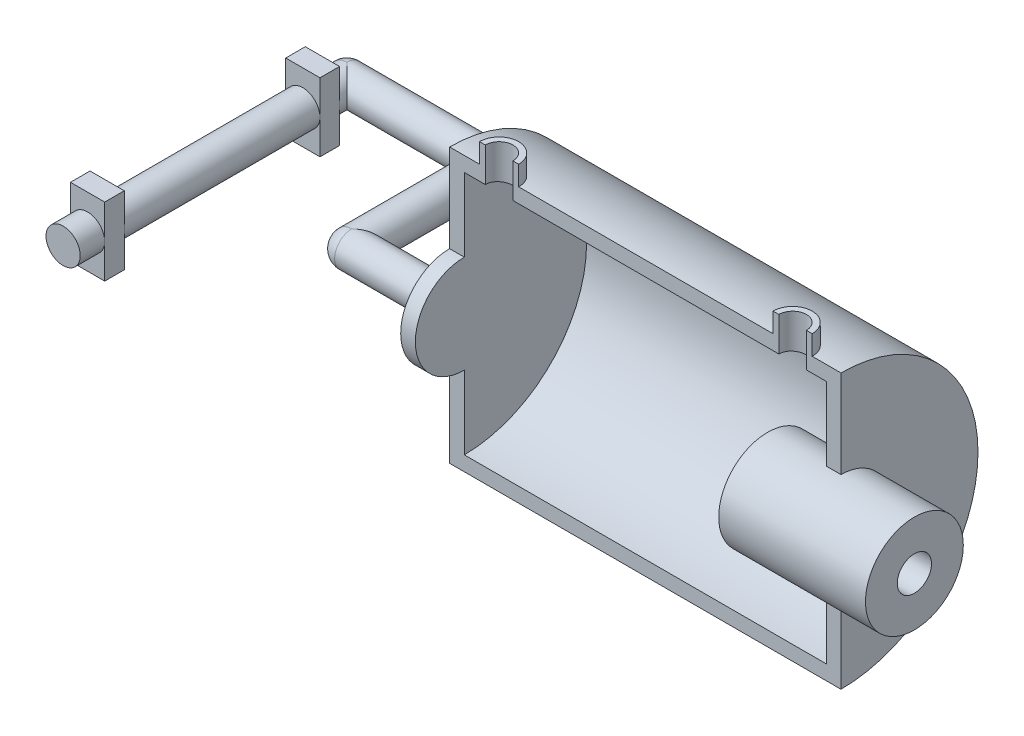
from build123d import *
from build123d.topology import SkipClean

# Parameters (mm, degrees)
ESQUISSE1_R                = 3.5
EXTRUSION1_DEPTH           = 20
ESQUISSE2_W                = 7
ESQUISSE2_H                = 14
EXTRUSION2_DEPTH           = 4
EXTRUSION3_DEPTH           = 5
ESQUISSE4_R                = 3.5
EXTRUSION4_DEPTH           = 30
ESQUISSE5_W                = 3.5
ESQUISSE5_H                = 29
ESQUISSE6_W                = 20
ESQUISSE6_H                = 3.5
EXTRUSION5_DEPTH           = 15
EXTRUSION5_DEPTH_BACK      = 15
ESQUISSE8_R                = 10
ENL_V_MAT_EXTRU_1_DEPTH    = 91
ENL_V_START                = -65
ESQUISSE10_R               = 3.5
ENL_V_MAT_EXTRU_2_DEPTH    = 65
ESQUISSE14_W               = 4
ESQUISSE14_H               = 7
ENL_V_MAT_EXTRU_3_DEPTH    = 15
R_P_TITION_LIN_AIRE1_COUNT = 16
R_P_TITION_LIN_AIRE1_PITCH = 60


with BuildPart() as part:
    # Esquisse1 → Extrusion1 (new body)
    with BuildSketch(Plane.XY):
        Circle(ESQUISSE1_R)
    extrusion1 = extrude(amount=-EXTRUSION1_DEPTH)

    # Esquisse2 → Extrusion2 (add)
    with BuildSketch(Plane(origin=(0, 0, -20), x_dir=(-1, 0, 0), z_dir=(0, 0, -1))):
        Rectangle(ESQUISSE2_W, ESQUISSE2_H)
    extrusion2 = extrude(amount=EXTRUSION2_DEPTH)

    # Esquisse3 → Extrusion3 (add)
    with BuildSketch(Plane(origin=(0, 0, -24), x_dir=(-1, 0, 0), z_dir=(0, 0, -1))):
        with BuildLine():
            ThreePointArc((3.5, 0), (0, 3.5), (-3.5, 0))
            ThreePointArc((-3.5, 0), (0, -3.5), (3.5, 0))
        make_face()
    extrusion3 = extrude(amount=EXTRUSION3_DEPTH)

    # Sym_trie1: Extrusion1, Extrusion2, Extrusion3 across plane
    add(extrusion1.mirror(Plane.XY))
    add(extrusion2.mirror(Plane.XY))
    add(extrusion3.mirror(Plane.XY))

    # Esquisse4 → Extrusion4 (add)
    with BuildSketch(Plane(origin=(0, 0, 0), x_dir=(0, 0, -1), z_dir=(1, 0, 0))):
        with Locations(Location((29, 0, 0), (0, 0, 180))):
            Circle(ESQUISSE4_R)
    extrude(amount=EXTRUSION4_DEPTH)

    # Esquisse5 → R_volution1 (revolve)
    with BuildSketch(Plane(origin=(0, 0, 0), x_dir=(1, 0, 0), z_dir=(0, 1, 0)), mode=Mode.PRIVATE) as r_volution1_sk:
        with Locations((31.75, 14.5)):
            Rectangle(ESQUISSE5_W, ESQUISSE5_H)
    revolve(r_volution1_sk.sketch.rotate(Axis((30, 0, -29), (0, 0, 1)), 180), axis=Axis((30, 0, -29), (0, 0, 1)))

    # Esquisse6 → R_volution2 (revolve)
    with BuildSketch(Plane(origin=(0, 0, 0), x_dir=(1, 0, 0), z_dir=(0, 1, 0)), mode=Mode.PRIVATE) as r_volution2_sk:
        with Locations((40, 1.75)):
            Rectangle(ESQUISSE6_W, ESQUISSE6_H)
    revolve(r_volution2_sk.sketch.rotate(Axis((26.5, 0, 0), (1, 0, 0)), 180), axis=Axis((26.5, 0, 0), (1, 0, 0)))

    # Esquisse7 → R_volution3 (revolve)
    with BuildSketch(Plane.XY, mode=Mode.PRIVATE) as r_volution3_sk:
        Polygon((50, 0), (50, 28), (130, 28), (130, 0), (127, 0), (127, 25), (53, 25), (53, 0), align=None)
    revolve(r_volution3_sk.sketch.rotate(Axis((0, 0, 0), (1, 0, 0)), 90), axis=Axis((0, 0, 0), (1, 0, 0)))

    # Esquisse8 → Extrusion5 (add, two sides: drawn at the far end of the back side and taken through both)
    with BuildSketch(Plane(origin=(130, 0, 0), x_dir=(0, 0, -1), z_dir=(1, 0, 0)).offset(-EXTRUSION5_DEPTH_BACK)):
        with Locations(Location((0, 0, 0), (0, 0, 180))):
            Circle(ESQUISSE8_R)
    extrude(amount=EXTRUSION5_DEPTH + EXTRUSION5_DEPTH_BACK)

    # Esquisse9 → Enl_v. mat.-Extru.1 (cut)
    with SkipClean():  # the faces are left unmerged after this step: merging them gives an invalid solid
        with BuildSketch(Plane(origin=(130, 0, 0), x_dir=(0, 0, -1), z_dir=(1, 0, 0))):
            with BuildLine():
                Line((0, 28), (0, 10))
                ThreePointArc((0, 10), (-10, 0), (0, -10))
                Line((0, -10), (0, -28))
                ThreePointArc((0, -28), (-28, 0), (0, 28))
            make_face()
        extrude(amount=-ENL_V_MAT_EXTRU_1_DEPTH, mode=Mode.SUBTRACT)

    # Esquisse10 → Enl_v. mat.-Extru.2 (cut)
    with SkipClean():  # the faces are left unmerged after this step: merging them gives an invalid solid
        with BuildSketch(Plane(origin=(145, 0, 0), x_dir=(0, 0, -1), z_dir=(1, 0, 0)).offset(ENL_V_START)):
            with Locations(Location((0, 0, 0), (0, 0, 270))):
                Circle(ESQUISSE10_R)
        extrude(amount=ENL_V_MAT_EXTRU_2_DEPTH, mode=Mode.SUBTRACT)

    # Esquisse11 → R_volution4 (revolve)
    with SkipClean():  # the faces are left unmerged after this step: merging them gives an invalid solid
        with BuildSketch(Plane(origin=(0, 0, -29), x_dir=(-1, 0, 0), z_dir=(0, 0, -1))):
            with BuildLine():
                Line((0, 3.5), (0, -3.5))
                ThreePointArc((0, -3.5), (3.5, 0), (0, 3.5))
            make_face()
        revolve(axis=Axis((0, -9.306446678, -29), (0, 1, 0)))

    # Esquisse12 → R_volution5 (revolve)
    with SkipClean():  # the faces are left unmerged after this step: merging them gives an invalid solid
        with BuildSketch(Plane(origin=(0, 0, -29), x_dir=(-1, 0, 0), z_dir=(0, 0, -1))):
            with BuildLine():
                Line((-30, -3.5), (-30, 3.5))
                ThreePointArc((-30, 3.5), (-33.5, 0), (-30, -3.5))
            make_face()
        revolve(axis=Axis((30, -8.198363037, -29), (0, 1, 0)))

    # Esquisse13 → R_volution6 (revolve)
    with SkipClean():  # the faces are left unmerged after this step: merging them gives an invalid solid
        with BuildSketch(Plane.XY):
            with BuildLine():
                Line((30, -3.5), (30, 3.5))
                ThreePointArc((30, 3.5), (26.5, 0), (30, -3.5))
            make_face()
        revolve(axis=Axis((30, 11.489259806, 0), (0, -1, 0)))

    # Esquisse14 → R_volution7 (revolve)
    with SkipClean():  # the faces are left unmerged after this step: merging them gives an invalid solid
        with BuildSketch(Plane.XY, mode=Mode.PRIVATE) as r_volution7_sk:
            with Locations((58.107698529, 28.5)):
                Rectangle(ESQUISSE14_W, ESQUISSE14_H)
        r_volution7 = revolve(r_volution7_sk.sketch.rotate(Axis((60.107698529, 35.905368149, 0), (0, -1, 0)), 270), axis=Axis((60.107698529, 35.905368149, 0), (0, -1, 0)))

    # Esquisse15 → Enl_v. mat.-Extru.3 (cut)
    with SkipClean():  # the faces are left unmerged after this step: merging them gives an invalid solid
        with BuildSketch(Plane(origin=(0, 32, 0), x_dir=(-1, 0, 0), z_dir=(0, 1, 0))):
            with BuildLine():
                Line((-55.170116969, 0), (-57.290592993, 0))
                ThreePointArc((-57.290592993, 0), (-60.107698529, -2.817105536), (-62.924804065, 0))
                Line((-62.924804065, 0), (-67.510223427, 0))
                Line((-67.510223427, 0), (-67.510223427, 6.829228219))
                Line((-67.510223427, 6.829228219), (-55.170116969, 6.829228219))
                Line((-55.170116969, 6.829228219), (-55.170116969, 0))
            make_face()
        enl_v_mat_extru_3 = extrude(amount=-ENL_V_MAT_EXTRU_3_DEPTH, mode=Mode.SUBTRACT)

    # R_p_tition lin_aire1: R_volution7, Enl_v. mat.-Extru.3 ×16, 14 skipped
    with SkipClean():  # the faces are left unmerged after this step: merging them gives an invalid solid
        with Locations(*[(i * R_P_TITION_LIN_AIRE1_PITCH, 0, 0) for i in range(1, R_P_TITION_LIN_AIRE1_COUNT) if i not in (2, 3, 4, 5, 6, 7, 8, 9, 10, 11, 12, 13, 14, 15)]):
            add(r_volution7)
            add(enl_v_mat_extru_3, mode=Mode.SUBTRACT)


solid = part.part
